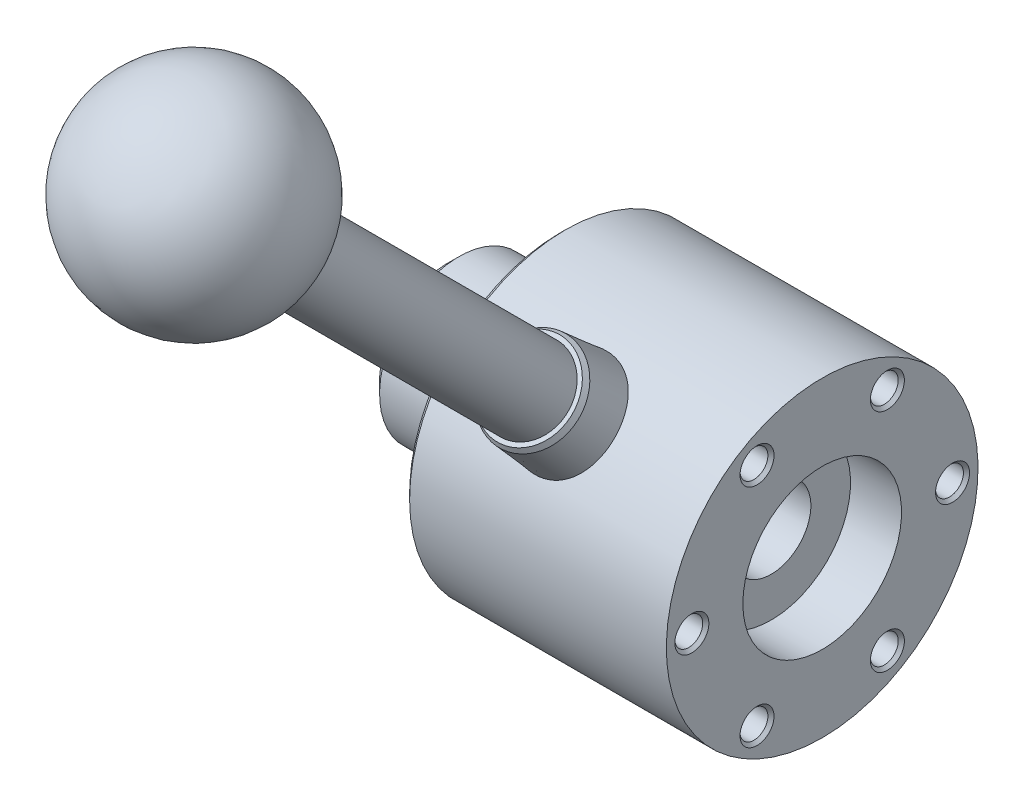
ISO-10303-21;
HEADER;
FILE_DESCRIPTION(('STEP AP214'),'2;1');
FILE_NAME('part.step','',(''),(''),'','','');
FILE_SCHEMA(('AUTOMOTIVE_DESIGN { 1 0 10303 214 1 1 1 1 }'));
ENDSEC;
DATA;
#1=APPLICATION_CONTEXT('core data for automotive mechanical design processes');
#2=APPLICATION_PROTOCOL_DEFINITION('international standard','automotive_design',2000,#1);
#3=PRODUCT_CONTEXT('',#1,'mechanical');
#4=PRODUCT('Part','Part','',(#3));
#5=PRODUCT_RELATED_PRODUCT_CATEGORY('part','',(#4));
#6=PRODUCT_DEFINITION_FORMATION('','',#4);
#7=PRODUCT_DEFINITION_CONTEXT('part definition',#1,'design');
#8=PRODUCT_DEFINITION('design','',#6,#7);
#9=PRODUCT_DEFINITION_SHAPE('','',#8);
#10=(LENGTH_UNIT() NAMED_UNIT(*) SI_UNIT(.MILLI.,.METRE.));
#11=(NAMED_UNIT(*) PLANE_ANGLE_UNIT() SI_UNIT($,.RADIAN.));
#12=(NAMED_UNIT(*) SI_UNIT($,.STERADIAN.) SOLID_ANGLE_UNIT());
#13=UNCERTAINTY_MEASURE_WITH_UNIT(LENGTH_MEASURE(1.E-05),#10,'distance_accuracy_value','');
#14=(GEOMETRIC_REPRESENTATION_CONTEXT(3) GLOBAL_UNCERTAINTY_ASSIGNED_CONTEXT((#13)) GLOBAL_UNIT_ASSIGNED_CONTEXT((#10,
#11,#12)) REPRESENTATION_CONTEXT('',''));
#15=CARTESIAN_POINT('',(0.,0.,0.));
#16=DIRECTION('',(0.,0.,1.));
#17=DIRECTION('',(1.,0.,0.));
#18=AXIS2_PLACEMENT_3D('',#15,#16,#17);
#19=CARTESIAN_POINT('',(0.,0.,0.));
#20=DIRECTION('',(-1.,0.,0.));
#21=DIRECTION('',(0.,-1.,0.));
#22=AXIS2_PLACEMENT_3D('',#19,#20,#21);
#23=CYLINDRICAL_SURFACE('',#22,14.);
#24=CARTESIAN_POINT('',(-64.1,0.,0.));
#25=DIRECTION('',(1.,0.,0.));
#26=DIRECTION('',(0.,0.,-1.));
#27=AXIS2_PLACEMENT_3D('',#24,#25,#26);
#28=CIRCLE('',#27,14.);
#29=CARTESIAN_POINT('',(-64.1,0.,-14.));
#30=VERTEX_POINT('',#29);
#31=EDGE_CURVE('E54',#30,#30,#28,.F.);
#32=ORIENTED_EDGE('',*,*,#31,.F.);
#33=EDGE_LOOP('',(#32));
#34=FACE_BOUND('',#33,.T.);
#35=CARTESIAN_POINT('',(-51.1,0.,0.));
#36=DIRECTION('',(-1.,0.,0.));
#37=DIRECTION('',(0.,-1.,0.));
#38=AXIS2_PLACEMENT_3D('',#35,#36,#37);
#39=CIRCLE('',#38,14.);
#40=CARTESIAN_POINT('',(-51.1,-14.,0.));
#41=VERTEX_POINT('',#40);
#42=EDGE_CURVE('E18',#41,#41,#39,.T.);
#43=ORIENTED_EDGE('',*,*,#42,.T.);
#44=EDGE_LOOP('',(#43));
#45=FACE_BOUND('',#44,.T.);
#46=ADVANCED_FACE('F14',(#34,#45),#23,.T.);
#47=CARTESIAN_POINT('',(-64.1,0.,0.));
#48=DIRECTION('',(1.,0.,0.));
#49=DIRECTION('',(0.,0.,-1.));
#50=AXIS2_PLACEMENT_3D('',#47,#48,#49);
#51=CONICAL_SURFACE('',#50,14.,0.785398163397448);
#52=ORIENTED_EDGE('',*,*,#31,.T.);
#53=EDGE_LOOP('',(#52));
#54=FACE_BOUND('',#53,.T.);
#55=CARTESIAN_POINT('',(-66.1,0.,0.));
#56=DIRECTION('',(1.,0.,0.));
#57=DIRECTION('',(0.,0.,-1.));
#58=AXIS2_PLACEMENT_3D('',#55,#56,#57);
#59=CIRCLE('',#58,12.);
#60=CARTESIAN_POINT('',(-66.1,0.,-12.));
#61=VERTEX_POINT('',#60);
#62=EDGE_CURVE('E147',#61,#61,#59,.T.);
#63=ORIENTED_EDGE('',*,*,#62,.T.);
#64=EDGE_LOOP('',(#63));
#65=FACE_BOUND('',#64,.T.);
#66=ADVANCED_FACE('F167',(#54,#65),#51,.T.);
#67=CARTESIAN_POINT('',(-26.,84.8528137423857,84.8528137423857));
#68=DIRECTION('',(-1.,0.,0.));
#69=DIRECTION('',(0.,0.707106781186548,-0.707106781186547));
#70=AXIS2_PLACEMENT_3D('',#67,#68,#69);
#71=SPHERICAL_SURFACE('',#70,18.5);
#72=CARTESIAN_POINT('',(-26.,84.8528137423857,84.8528137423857));
#73=DIRECTION('',(0.,0.707106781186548,0.707106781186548));
#74=DIRECTION('',(0.,-0.707106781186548,0.707106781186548));
#75=AXIS2_PLACEMENT_3D('',#72,#73,#74);
#76=SPHERICAL_SURFACE('',#75,18.5);
#77=CARTESIAN_POINT('',(-26.,72.7439327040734,72.7439327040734));
#78=DIRECTION('',(0.,0.707106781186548,0.707106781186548));
#79=DIRECTION('',(0.,-0.707106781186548,0.707106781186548));
#80=AXIS2_PLACEMENT_3D('',#77,#78,#79);
#81=CIRCLE('',#80,7.);
#82=CARTESIAN_POINT('',(-26.,67.7941852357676,77.6936801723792));
#83=VERTEX_POINT('',#82);
#84=EDGE_CURVE('E145',#83,#83,#81,.F.);
#85=ORIENTED_EDGE('',*,*,#84,.F.);
#86=EDGE_LOOP('',(#85));
#87=FACE_BOUND('',#86,.T.);
#88=ADVANCED_FACE('F16',(#87),#76,.T.);
#89=CARTESIAN_POINT('',(-51.1,14.,0.));
#90=DIRECTION('',(1.,0.,0.));
#91=DIRECTION('',(0.,1.,0.));
#92=AXIS2_PLACEMENT_3D('',#89,#90,#91);
#93=PLANE('',#92);
#94=CARTESIAN_POINT('',(-51.1,0.,0.));
#95=DIRECTION('',(-1.,0.,0.));
#96=DIRECTION('',(0.,-1.,0.));
#97=AXIS2_PLACEMENT_3D('',#94,#95,#96);
#98=CIRCLE('',#97,17.5);
#99=CARTESIAN_POINT('',(-51.1,-17.5,0.));
#100=VERTEX_POINT('',#99);
#101=EDGE_CURVE('E142',#100,#100,#98,.F.);
#102=ORIENTED_EDGE('',*,*,#101,.F.);
#103=EDGE_LOOP('',(#102));
#104=FACE_BOUND('',#103,.T.);
#105=ORIENTED_EDGE('',*,*,#42,.F.);
#106=EDGE_LOOP('',(#105));
#107=FACE_BOUND('',#106,.T.);
#108=ADVANCED_FACE('F155',(#104,#107),#93,.F.);
#109=CARTESIAN_POINT('',(-66.1,0.,0.));
#110=DIRECTION('',(1.,0.,0.));
#111=DIRECTION('',(0.,1.,0.));
#112=AXIS2_PLACEMENT_3D('',#109,#110,#111);
#113=PLANE('',#112);
#114=ORIENTED_EDGE('',*,*,#62,.F.);
#115=EDGE_LOOP('',(#114));
#116=FACE_BOUND('',#115,.T.);
#117=CARTESIAN_POINT('',(-66.1,0.,0.));
#118=DIRECTION('',(-1.,0.,0.));
#119=DIRECTION('',(0.,0.,1.));
#120=AXIS2_PLACEMENT_3D('',#117,#118,#119);
#121=CIRCLE('',#120,7.);
#122=CARTESIAN_POINT('',(-66.1,0.,7.));
#123=VERTEX_POINT('',#122);
#124=EDGE_CURVE('E139',#123,#123,#121,.F.);
#125=ORIENTED_EDGE('',*,*,#124,.T.);
#126=EDGE_LOOP('',(#125));
#127=FACE_BOUND('',#126,.T.);
#128=ADVANCED_FACE('F157',(#116,#127),#113,.F.);
#129=CARTESIAN_POINT('',(-26.,11.0293808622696,11.0293808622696));
#130=DIRECTION('',(0.,0.707106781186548,0.707106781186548));
#131=DIRECTION('',(0.,-0.707106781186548,0.707106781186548));
#132=AXIS2_PLACEMENT_3D('',#129,#130,#131);
#133=CYLINDRICAL_SURFACE('',#132,7.);
#134=ORIENTED_EDGE('',*,*,#84,.T.);
#135=EDGE_LOOP('',(#134));
#136=FACE_BOUND('',#135,.T.);
#137=CARTESIAN_POINT('',(-26.,25.809397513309,25.809397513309));
#138=DIRECTION('',(0.,0.707106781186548,0.707106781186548));
#139=DIRECTION('',(0.,-0.707106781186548,0.707106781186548));
#140=AXIS2_PLACEMENT_3D('',#137,#138,#139);
#141=CIRCLE('',#140,7.);
#142=CARTESIAN_POINT('',(-26.,20.8596500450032,30.7591449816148));
#143=VERTEX_POINT('',#142);
#144=EDGE_CURVE('E136',#143,#143,#141,.T.);
#145=ORIENTED_EDGE('',*,*,#144,.T.);
#146=EDGE_LOOP('',(#145));
#147=FACE_BOUND('',#146,.T.);
#148=ADVANCED_FACE('F164',(#136,#147),#133,.T.);
#149=CARTESIAN_POINT('',(0.,0.,0.));
#150=DIRECTION('',(-1.,0.,0.));
#151=DIRECTION('',(0.,-1.,0.));
#152=AXIS2_PLACEMENT_3D('',#149,#150,#151);
#153=CYLINDRICAL_SURFACE('',#152,17.5);
#154=ORIENTED_EDGE('',*,*,#101,.T.);
#155=EDGE_LOOP('',(#154));
#156=FACE_BOUND('',#155,.T.);
#157=CARTESIAN_POINT('',(-48.,0.,0.));
#158=DIRECTION('',(-1.,0.,0.));
#159=DIRECTION('',(0.,-1.,0.));
#160=AXIS2_PLACEMENT_3D('',#157,#158,#159);
#161=CIRCLE('',#160,17.5);
#162=CARTESIAN_POINT('',(-48.,-17.5,0.));
#163=VERTEX_POINT('',#162);
#164=EDGE_CURVE('E133',#163,#163,#161,.T.);
#165=ORIENTED_EDGE('',*,*,#164,.T.);
#166=EDGE_LOOP('',(#165));
#167=FACE_BOUND('',#166,.T.);
#168=ADVANCED_FACE('F212',(#156,#167),#153,.T.);
#169=CARTESIAN_POINT('',(-9.,0.,-23.));
#170=DIRECTION('',(1.,0.,0.));
#171=DIRECTION('',(0.,0.,-1.));
#172=AXIS2_PLACEMENT_3D('',#169,#170,#171);
#173=PLANE('',#172);
#174=CARTESIAN_POINT('',(-9.,0.,-23.));
#175=DIRECTION('',(-1.,0.,0.));
#176=DIRECTION('',(0.,0.,1.));
#177=AXIS2_PLACEMENT_3D('',#174,#175,#176);
#178=CIRCLE('',#177,2.4585);
#179=CARTESIAN_POINT('',(-9.,0.,-20.5415));
#180=VERTEX_POINT('',#179);
#181=EDGE_CURVE('E130',#180,#180,#178,.F.);
#182=ORIENTED_EDGE('',*,*,#181,.T.);
#183=EDGE_LOOP('',(#182));
#184=FACE_BOUND('',#183,.T.);
#185=ADVANCED_FACE('F221',(#184),#173,.T.);
#186=CARTESIAN_POINT('',(-9.,0.,25.4585));
#187=DIRECTION('',(1.,0.,0.));
#188=DIRECTION('',(0.,0.,-1.));
#189=AXIS2_PLACEMENT_3D('',#186,#187,#188);
#190=PLANE('',#189);
#191=CARTESIAN_POINT('',(-9.,0.,23.));
#192=DIRECTION('',(1.,0.,0.));
#193=DIRECTION('',(0.,0.,-1.));
#194=AXIS2_PLACEMENT_3D('',#191,#192,#193);
#195=CIRCLE('',#194,2.4585);
#196=CARTESIAN_POINT('',(-9.,0.,20.5415));
#197=VERTEX_POINT('',#196);
#198=EDGE_CURVE('E127',#197,#197,#195,.T.);
#199=ORIENTED_EDGE('',*,*,#198,.T.);
#200=EDGE_LOOP('',(#199));
#201=FACE_BOUND('',#200,.T.);
#202=ADVANCED_FACE('F231',(#201),#190,.T.);
#203=CARTESIAN_POINT('',(-9.,19.9185842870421,-11.5));
#204=DIRECTION('',(1.,0.,0.));
#205=DIRECTION('',(0.,0.,-1.));
#206=AXIS2_PLACEMENT_3D('',#203,#204,#205);
#207=PLANE('',#206);
#208=CARTESIAN_POINT('',(-9.,19.9185842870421,-11.5));
#209=DIRECTION('',(-1.,0.,0.));
#210=DIRECTION('',(0.,0.,1.));
#211=AXIS2_PLACEMENT_3D('',#208,#209,#210);
#212=CIRCLE('',#211,2.4585);
#213=CARTESIAN_POINT('',(-9.,19.9185842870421,-9.0415));
#214=VERTEX_POINT('',#213);
#215=EDGE_CURVE('E124',#214,#214,#212,.F.);
#216=ORIENTED_EDGE('',*,*,#215,.T.);
#217=EDGE_LOOP('',(#216));
#218=FACE_BOUND('',#217,.T.);
#219=ADVANCED_FACE('F241',(#218),#207,.T.);
#220=CARTESIAN_POINT('',(-9.,-22.0477077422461,12.72925));
#221=DIRECTION('',(1.,0.,0.));
#222=DIRECTION('',(0.,0.,-1.));
#223=AXIS2_PLACEMENT_3D('',#220,#221,#222);
#224=PLANE('',#223);
#225=CARTESIAN_POINT('',(-9.,-19.9185842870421,11.5));
#226=DIRECTION('',(1.,0.,0.));
#227=DIRECTION('',(0.,0.,-1.));
#228=AXIS2_PLACEMENT_3D('',#225,#226,#227);
#229=CIRCLE('',#228,2.4585);
#230=CARTESIAN_POINT('',(-9.,-19.9185842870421,9.0415));
#231=VERTEX_POINT('',#230);
#232=EDGE_CURVE('E121',#231,#231,#229,.T.);
#233=ORIENTED_EDGE('',*,*,#232,.T.);
#234=EDGE_LOOP('',(#233));
#235=FACE_BOUND('',#234,.T.);
#236=ADVANCED_FACE('F251',(#235),#224,.T.);
#237=CARTESIAN_POINT('',(-9.,-22.0477077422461,-12.72925));
#238=DIRECTION('',(1.,0.,0.));
#239=DIRECTION('',(0.,0.,-1.));
#240=AXIS2_PLACEMENT_3D('',#237,#238,#239);
#241=PLANE('',#240);
#242=CARTESIAN_POINT('',(-9.,-19.9185842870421,-11.5));
#243=DIRECTION('',(1.,0.,0.));
#244=DIRECTION('',(0.,0.,-1.));
#245=AXIS2_PLACEMENT_3D('',#242,#243,#244);
#246=CIRCLE('',#245,2.4585);
#247=CARTESIAN_POINT('',(-9.,-19.9185842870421,-13.9585));
#248=VERTEX_POINT('',#247);
#249=EDGE_CURVE('E118',#248,#248,#246,.T.);
#250=ORIENTED_EDGE('',*,*,#249,.T.);
#251=EDGE_LOOP('',(#250));
#252=FACE_BOUND('',#251,.T.);
#253=ADVANCED_FACE('F261',(#252),#241,.T.);
#254=CARTESIAN_POINT('',(-9.,19.9185842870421,11.5));
#255=DIRECTION('',(1.,0.,0.));
#256=DIRECTION('',(0.,0.,-1.));
#257=AXIS2_PLACEMENT_3D('',#254,#255,#256);
#258=PLANE('',#257);
#259=CARTESIAN_POINT('',(-9.,19.9185842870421,11.5));
#260=DIRECTION('',(-1.,0.,0.));
#261=DIRECTION('',(0.,0.,1.));
#262=AXIS2_PLACEMENT_3D('',#259,#260,#261);
#263=CIRCLE('',#262,2.4585);
#264=CARTESIAN_POINT('',(-9.,19.9185842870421,13.9585));
#265=VERTEX_POINT('',#264);
#266=EDGE_CURVE('E115',#265,#265,#263,.F.);
#267=ORIENTED_EDGE('',*,*,#266,.T.);
#268=EDGE_LOOP('',(#267));
#269=FACE_BOUND('',#268,.T.);
#270=ADVANCED_FACE('F271',(#269),#258,.T.);
#271=CARTESIAN_POINT('',(0.,0.,0.));
#272=DIRECTION('',(-1.,0.,0.));
#273=DIRECTION('',(0.,0.,1.));
#274=AXIS2_PLACEMENT_3D('',#271,#272,#273);
#275=CYLINDRICAL_SURFACE('',#274,7.);
#276=ORIENTED_EDGE('',*,*,#124,.F.);
#277=EDGE_LOOP('',(#276));
#278=FACE_BOUND('',#277,.T.);
#279=CARTESIAN_POINT('',(-9.,0.,0.));
#280=DIRECTION('',(-1.,0.,0.));
#281=DIRECTION('',(0.,0.,1.));
#282=AXIS2_PLACEMENT_3D('',#279,#280,#281);
#283=CIRCLE('',#282,7.);
#284=CARTESIAN_POINT('',(-9.,0.,7.));
#285=VERTEX_POINT('',#284);
#286=EDGE_CURVE('E112',#285,#285,#283,.T.);
#287=ORIENTED_EDGE('',*,*,#286,.F.);
#288=EDGE_LOOP('',(#287));
#289=FACE_BOUND('',#288,.T.);
#290=ADVANCED_FACE('F281',(#278,#289),#275,.F.);
#291=CARTESIAN_POINT('',(-33.,25.809397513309,25.809397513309));
#292=DIRECTION('',(0.,-0.707106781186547,-0.707106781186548));
#293=DIRECTION('',(0.,0.707106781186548,-0.707106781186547));
#294=AXIS2_PLACEMENT_3D('',#291,#292,#293);
#295=PLANE('',#294);
#296=CARTESIAN_POINT('',(-26.,25.809397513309,25.809397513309));
#297=DIRECTION('',(0.,-0.707106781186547,-0.707106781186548));
#298=DIRECTION('',(0.,0.707106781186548,-0.707106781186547));
#299=AXIS2_PLACEMENT_3D('',#296,#297,#298);
#300=CIRCLE('',#299,7.75000000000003);
#301=CARTESIAN_POINT('',(-26.,31.2894750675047,20.3293199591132));
#302=VERTEX_POINT('',#301);
#303=EDGE_CURVE('E109',#302,#302,#300,.T.);
#304=ORIENTED_EDGE('',*,*,#303,.F.);
#305=EDGE_LOOP('',(#304));
#306=FACE_BOUND('',#305,.T.);
#307=ORIENTED_EDGE('',*,*,#144,.F.);
#308=EDGE_LOOP('',(#307));
#309=FACE_BOUND('',#308,.T.);
#310=ADVANCED_FACE('F291',(#306,#309),#295,.F.);
#311=CARTESIAN_POINT('',(-48.,17.5,0.));
#312=DIRECTION('',(1.,0.,0.));
#313=DIRECTION('',(0.,1.,0.));
#314=AXIS2_PLACEMENT_3D('',#311,#312,#313);
#315=PLANE('',#314);
#316=CARTESIAN_POINT('',(-48.,0.,0.));
#317=DIRECTION('',(-1.,0.,0.));
#318=DIRECTION('',(0.,-1.,0.));
#319=AXIS2_PLACEMENT_3D('',#316,#317,#318);
#320=CIRCLE('',#319,21.25);
#321=CARTESIAN_POINT('',(-48.,-21.25,0.));
#322=VERTEX_POINT('',#321);
#323=EDGE_CURVE('E53',#322,#322,#320,.F.);
#324=ORIENTED_EDGE('',*,*,#323,.F.);
#325=EDGE_LOOP('',(#324));
#326=FACE_BOUND('',#325,.T.);
#327=ORIENTED_EDGE('',*,*,#164,.F.);
#328=EDGE_LOOP('',(#327));
#329=FACE_BOUND('',#328,.T.);
#330=ADVANCED_FACE('F301',(#326,#329),#315,.F.);
#331=CARTESIAN_POINT('',(0.,0.,-23.));
#332=DIRECTION('',(-1.,0.,0.));
#333=DIRECTION('',(0.,0.,1.));
#334=AXIS2_PLACEMENT_3D('',#331,#332,#333);
#335=CYLINDRICAL_SURFACE('',#334,2.4585);
#336=CARTESIAN_POINT('',(-0.541499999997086,0.,-23.));
#337=DIRECTION('',(1.,0.,0.));
#338=DIRECTION('',(0.,0.,-1.));
#339=AXIS2_PLACEMENT_3D('',#336,#337,#338);
#340=CIRCLE('',#339,2.45850000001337);
#341=CARTESIAN_POINT('',(-0.541499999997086,0.,-25.4585000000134));
#342=VERTEX_POINT('',#341);
#343=EDGE_CURVE('E50',#342,#342,#340,.T.);
#344=ORIENTED_EDGE('',*,*,#343,.T.);
#345=EDGE_LOOP('',(#344));
#346=FACE_BOUND('',#345,.T.);
#347=ORIENTED_EDGE('',*,*,#181,.F.);
#348=EDGE_LOOP('',(#347));
#349=FACE_BOUND('',#348,.T.);
#350=ADVANCED_FACE('F311',(#346,#349),#335,.F.);
#351=CARTESIAN_POINT('',(-9.,0.,23.));
#352=DIRECTION('',(1.,0.,0.));
#353=DIRECTION('',(0.,0.,-1.));
#354=AXIS2_PLACEMENT_3D('',#351,#352,#353);
#355=CYLINDRICAL_SURFACE('',#354,2.4585);
#356=ORIENTED_EDGE('',*,*,#198,.F.);
#357=EDGE_LOOP('',(#356));
#358=FACE_BOUND('',#357,.T.);
#359=CARTESIAN_POINT('',(-0.541500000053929,0.,23.));
#360=DIRECTION('',(1.,0.,0.));
#361=DIRECTION('',(0.,0.,-1.));
#362=AXIS2_PLACEMENT_3D('',#359,#360,#361);
#363=CIRCLE('',#362,2.45849999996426);
#364=CARTESIAN_POINT('',(-0.541500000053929,0.,20.5415000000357));
#365=VERTEX_POINT('',#364);
#366=EDGE_CURVE('E47',#365,#365,#363,.T.);
#367=ORIENTED_EDGE('',*,*,#366,.T.);
#368=EDGE_LOOP('',(#367));
#369=FACE_BOUND('',#368,.T.);
#370=ADVANCED_FACE('F321',(#358,#369),#355,.F.);
#371=CARTESIAN_POINT('',(0.,19.9185842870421,-11.5));
#372=DIRECTION('',(-1.,0.,0.));
#373=DIRECTION('',(0.,0.,1.));
#374=AXIS2_PLACEMENT_3D('',#371,#372,#373);
#375=CYLINDRICAL_SURFACE('',#374,2.4585);
#376=CARTESIAN_POINT('',(-0.541499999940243,19.9185842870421,-11.5));
#377=DIRECTION('',(1.,0.,0.));
#378=DIRECTION('',(0.,0.,-1.));
#379=AXIS2_PLACEMENT_3D('',#376,#377,#378);
#380=CIRCLE('',#379,2.4585000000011);
#381=CARTESIAN_POINT('',(-0.541499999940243,19.9185842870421,-13.9585000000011));
#382=VERTEX_POINT('',#381);
#383=EDGE_CURVE('E44',#382,#382,#380,.T.);
#384=ORIENTED_EDGE('',*,*,#383,.T.);
#385=EDGE_LOOP('',(#384));
#386=FACE_BOUND('',#385,.T.);
#387=ORIENTED_EDGE('',*,*,#215,.F.);
#388=EDGE_LOOP('',(#387));
#389=FACE_BOUND('',#388,.T.);
#390=ADVANCED_FACE('F331',(#386,#389),#375,.F.);
#391=CARTESIAN_POINT('',(-9.,-19.9185842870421,11.5));
#392=DIRECTION('',(1.,0.,0.));
#393=DIRECTION('',(0.,0.,-1.));
#394=AXIS2_PLACEMENT_3D('',#391,#392,#393);
#395=CYLINDRICAL_SURFACE('',#394,2.4585);
#396=ORIENTED_EDGE('',*,*,#232,.F.);
#397=EDGE_LOOP('',(#396));
#398=FACE_BOUND('',#397,.T.);
#399=CARTESIAN_POINT('',(-0.541500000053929,-19.9185842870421,11.5));
#400=DIRECTION('',(1.,0.,0.));
#401=DIRECTION('',(0.,0.,-1.));
#402=AXIS2_PLACEMENT_3D('',#399,#400,#401);
#403=CIRCLE('',#402,2.45849999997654);
#404=CARTESIAN_POINT('',(-0.541500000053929,-19.9185842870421,9.04150000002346));
#405=VERTEX_POINT('',#404);
#406=EDGE_CURVE('E41',#405,#405,#403,.T.);
#407=ORIENTED_EDGE('',*,*,#406,.T.);
#408=EDGE_LOOP('',(#407));
#409=FACE_BOUND('',#408,.T.);
#410=ADVANCED_FACE('F341',(#398,#409),#395,.F.);
#411=CARTESIAN_POINT('',(-9.,-19.9185842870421,-11.5));
#412=DIRECTION('',(1.,0.,0.));
#413=DIRECTION('',(0.,0.,-1.));
#414=AXIS2_PLACEMENT_3D('',#411,#412,#413);
#415=CYLINDRICAL_SURFACE('',#414,2.4585);
#416=ORIENTED_EDGE('',*,*,#249,.F.);
#417=EDGE_LOOP('',(#416));
#418=FACE_BOUND('',#417,.T.);
#419=CARTESIAN_POINT('',(-0.541499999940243,-19.9185842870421,-11.5));
#420=DIRECTION('',(1.,0.,0.));
#421=DIRECTION('',(0.,0.,-1.));
#422=AXIS2_PLACEMENT_3D('',#419,#420,#421);
#423=CIRCLE('',#422,2.4585000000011);
#424=CARTESIAN_POINT('',(-0.541499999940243,-19.9185842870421,-13.9585000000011));
#425=VERTEX_POINT('',#424);
#426=EDGE_CURVE('E38',#425,#425,#423,.T.);
#427=ORIENTED_EDGE('',*,*,#426,.T.);
#428=EDGE_LOOP('',(#427));
#429=FACE_BOUND('',#428,.T.);
#430=ADVANCED_FACE('F351',(#418,#429),#415,.F.);
#431=CARTESIAN_POINT('',(0.,19.9185842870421,11.5));
#432=DIRECTION('',(-1.,0.,0.));
#433=DIRECTION('',(0.,0.,1.));
#434=AXIS2_PLACEMENT_3D('',#431,#432,#433);
#435=CYLINDRICAL_SURFACE('',#434,2.4585);
#436=CARTESIAN_POINT('',(-0.541500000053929,19.9185842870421,11.5));
#437=DIRECTION('',(1.,0.,0.));
#438=DIRECTION('',(0.,0.,-1.));
#439=AXIS2_PLACEMENT_3D('',#436,#437,#438);
#440=CIRCLE('',#439,2.45849999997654);
#441=CARTESIAN_POINT('',(-0.541500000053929,19.9185842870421,9.04150000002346));
#442=VERTEX_POINT('',#441);
#443=EDGE_CURVE('E35',#442,#442,#440,.T.);
#444=ORIENTED_EDGE('',*,*,#443,.T.);
#445=EDGE_LOOP('',(#444));
#446=FACE_BOUND('',#445,.T.);
#447=ORIENTED_EDGE('',*,*,#266,.F.);
#448=EDGE_LOOP('',(#447));
#449=FACE_BOUND('',#448,.T.);
#450=ADVANCED_FACE('F361',(#446,#449),#435,.F.);
#451=CARTESIAN_POINT('',(-9.,7.,0.));
#452=DIRECTION('',(1.,0.,0.));
#453=DIRECTION('',(0.,0.,-1.));
#454=AXIS2_PLACEMENT_3D('',#451,#452,#453);
#455=PLANE('',#454);
#456=CARTESIAN_POINT('',(-9.,0.,0.));
#457=DIRECTION('',(-1.,0.,0.));
#458=DIRECTION('',(0.,0.,1.));
#459=AXIS2_PLACEMENT_3D('',#456,#457,#458);
#460=CIRCLE('',#459,14.);
#461=CARTESIAN_POINT('',(-9.,0.,14.));
#462=VERTEX_POINT('',#461);
#463=EDGE_CURVE('E34',#462,#462,#460,.F.);
#464=ORIENTED_EDGE('',*,*,#463,.T.);
#465=EDGE_LOOP('',(#464));
#466=FACE_BOUND('',#465,.T.);
#467=ORIENTED_EDGE('',*,*,#286,.T.);
#468=EDGE_LOOP('',(#467));
#469=FACE_BOUND('',#468,.T.);
#470=ADVANCED_FACE('F371',(#466,#469),#455,.T.);
#471=CARTESIAN_POINT('',(-26.,25.1022907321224,25.1022907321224));
#472=DIRECTION('',(0.,-0.707106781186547,-0.707106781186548));
#473=DIRECTION('',(0.,0.707106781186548,-0.707106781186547));
#474=AXIS2_PLACEMENT_3D('',#471,#472,#473);
#475=CONICAL_SURFACE('',#474,8.25000000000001,0.463647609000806);
#476=ORIENTED_EDGE('',*,*,#303,.T.);
#477=EDGE_LOOP('',(#476));
#478=FACE_BOUND('',#477,.T.);
#479=CARTESIAN_POINT('',(-26.,25.1022907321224,25.1022907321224));
#480=DIRECTION('',(0.,-0.707106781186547,-0.707106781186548));
#481=DIRECTION('',(0.,0.707106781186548,-0.707106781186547));
#482=AXIS2_PLACEMENT_3D('',#479,#480,#481);
#483=CIRCLE('',#482,8.24999999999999);
#484=CARTESIAN_POINT('',(-26.,30.9359216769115,19.2686597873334));
#485=VERTEX_POINT('',#484);
#486=EDGE_CURVE('E30',#485,#485,#483,.T.);
#487=ORIENTED_EDGE('',*,*,#486,.F.);
#488=EDGE_LOOP('',(#487));
#489=FACE_BOUND('',#488,.T.);
#490=ADVANCED_FACE('F381',(#478,#489),#475,.T.);
#491=CARTESIAN_POINT('',(0.,0.,0.));
#492=DIRECTION('',(-1.,0.,0.));
#493=DIRECTION('',(0.,-1.,0.));
#494=AXIS2_PLACEMENT_3D('',#491,#492,#493);
#495=CYLINDRICAL_SURFACE('',#494,21.25);
#496=ORIENTED_EDGE('',*,*,#323,.T.);
#497=EDGE_LOOP('',(#496));
#498=FACE_BOUND('',#497,.T.);
#499=CARTESIAN_POINT('',(-46.3,0.,0.));
#500=DIRECTION('',(-1.,0.,0.));
#501=DIRECTION('',(0.,-1.,0.));
#502=AXIS2_PLACEMENT_3D('',#499,#500,#501);
#503=CIRCLE('',#502,21.25);
#504=CARTESIAN_POINT('',(-46.3,-21.25,0.));
#505=VERTEX_POINT('',#504);
#506=EDGE_CURVE('E33',#505,#505,#503,.T.);
#507=ORIENTED_EDGE('',*,*,#506,.T.);
#508=EDGE_LOOP('',(#507));
#509=FACE_BOUND('',#508,.T.);
#510=ADVANCED_FACE('F391',(#498,#509),#495,.T.);
#511=CARTESIAN_POINT('',(0.,0.,-23.));
#512=DIRECTION('',(1.,0.,0.));
#513=DIRECTION('',(0.,0.,-1.));
#514=AXIS2_PLACEMENT_3D('',#511,#512,#513);
#515=CONICAL_SURFACE('',#514,3.00000000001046,0.785398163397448);
#516=ORIENTED_EDGE('',*,*,#343,.F.);
#517=EDGE_LOOP('',(#516));
#518=FACE_BOUND('',#517,.T.);
#519=CARTESIAN_POINT('',(0.,0.,-23.));
#520=DIRECTION('',(1.,0.,0.));
#521=DIRECTION('',(0.,0.,-1.));
#522=AXIS2_PLACEMENT_3D('',#519,#520,#521);
#523=CIRCLE('',#522,3.00000000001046);
#524=CARTESIAN_POINT('',(0.,0.,-26.0000000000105));
#525=VERTEX_POINT('',#524);
#526=EDGE_CURVE('E98',#525,#525,#523,.T.);
#527=ORIENTED_EDGE('',*,*,#526,.T.);
#528=EDGE_LOOP('',(#527));
#529=FACE_BOUND('',#528,.T.);
#530=ADVANCED_FACE('F401',(#518,#529),#515,.F.);
#531=CARTESIAN_POINT('',(-5.6843418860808E-11,0.,23.));
#532=DIRECTION('',(1.,0.,0.));
#533=DIRECTION('',(0.,0.,-1.));
#534=AXIS2_PLACEMENT_3D('',#531,#532,#533);
#535=CONICAL_SURFACE('',#534,3.00000000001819,0.785398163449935);
#536=ORIENTED_EDGE('',*,*,#366,.F.);
#537=EDGE_LOOP('',(#536));
#538=FACE_BOUND('',#537,.T.);
#539=CARTESIAN_POINT('',(-8.91300921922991E-11,0.,23.));
#540=DIRECTION('',(1.,0.,0.));
#541=DIRECTION('',(0.,0.,-1.));
#542=AXIS2_PLACEMENT_3D('',#539,#540,#541);
#543=CIRCLE('',#542,2.9999999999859);
#544=CARTESIAN_POINT('',(-8.91300921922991E-11,0.,20.0000000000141));
#545=VERTEX_POINT('',#544);
#546=EDGE_CURVE('E101',#545,#545,#543,.T.);
#547=ORIENTED_EDGE('',*,*,#546,.T.);
#548=EDGE_LOOP('',(#547));
#549=FACE_BOUND('',#548,.T.);
#550=ADVANCED_FACE('F411',(#538,#549),#535,.F.);
#551=CARTESIAN_POINT('',(5.6843418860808E-11,19.9185842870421,-11.5));
#552=DIRECTION('',(1.,0.,0.));
#553=DIRECTION('',(0.,0.,-1.));
#554=AXIS2_PLACEMENT_3D('',#551,#552,#553);
#555=CONICAL_SURFACE('',#554,2.99999999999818,0.785398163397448);
#556=ORIENTED_EDGE('',*,*,#383,.F.);
#557=EDGE_LOOP('',(#556));
#558=FACE_BOUND('',#557,.T.);
#559=CARTESIAN_POINT('',(5.6843418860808E-11,19.9185842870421,-11.5));
#560=DIRECTION('',(1.,0.,0.));
#561=DIRECTION('',(0.,0.,-1.));
#562=AXIS2_PLACEMENT_3D('',#559,#560,#561);
#563=CIRCLE('',#562,2.99999999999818);
#564=CARTESIAN_POINT('',(5.6843418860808E-11,19.9185842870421,-14.4999999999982));
#565=VERTEX_POINT('',#564);
#566=EDGE_CURVE('E631',#565,#565,#563,.T.);
#567=ORIENTED_EDGE('',*,*,#566,.T.);
#568=EDGE_LOOP('',(#567));
#569=FACE_BOUND('',#568,.T.);
#570=ADVANCED_FACE('F421',(#558,#569),#555,.F.);
#571=CARTESIAN_POINT('',(-1.13686837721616E-10,-19.9185842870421,11.5));
#572=DIRECTION('',(1.,0.,0.));
#573=DIRECTION('',(0.,0.,-1.));
#574=AXIS2_PLACEMENT_3D('',#571,#572,#573);
#575=CONICAL_SURFACE('',#574,2.99999999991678,0.785398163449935);
#576=ORIENTED_EDGE('',*,*,#406,.F.);
#577=EDGE_LOOP('',(#576));
#578=FACE_BOUND('',#577,.T.);
#579=CARTESIAN_POINT('',(-4.45650461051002E-11,-19.9185842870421,11.5));
#580=DIRECTION('',(1.,0.,0.));
#581=DIRECTION('',(0.,0.,-1.));
#582=AXIS2_PLACEMENT_3D('',#579,#580,#581);
#583=CIRCLE('',#582,2.9999999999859);
#584=CARTESIAN_POINT('',(-4.45650461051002E-11,-19.9185842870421,8.5000000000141));
#585=VERTEX_POINT('',#584);
#586=EDGE_CURVE('E626',#585,#585,#583,.T.);
#587=ORIENTED_EDGE('',*,*,#586,.T.);
#588=EDGE_LOOP('',(#587));
#589=FACE_BOUND('',#588,.T.);
#590=ADVANCED_FACE('F431',(#578,#589),#575,.F.);
#591=CARTESIAN_POINT('',(1.70530256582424E-10,-19.9185842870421,-11.5));
#592=DIRECTION('',(1.,0.,0.));
#593=DIRECTION('',(0.,0.,-1.));
#594=AXIS2_PLACEMENT_3D('',#591,#592,#593);
#595=CONICAL_SURFACE('',#594,3.00000000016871,0.785398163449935);
#596=ORIENTED_EDGE('',*,*,#426,.F.);
#597=EDGE_LOOP('',(#596));
#598=FACE_BOUND('',#597,.T.);
#599=CARTESIAN_POINT('',(1.01408464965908E-10,-19.9185842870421,-11.5));
#600=DIRECTION('',(1.,0.,0.));
#601=DIRECTION('',(0.,0.,-1.));
#602=AXIS2_PLACEMENT_3D('',#599,#600,#601);
#603=CIRCLE('',#602,3.00000000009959);
#604=CARTESIAN_POINT('',(1.01408464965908E-10,-19.9185842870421,-14.5000000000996));
#605=VERTEX_POINT('',#604);
#606=EDGE_CURVE('E622',#605,#605,#603,.T.);
#607=ORIENTED_EDGE('',*,*,#606,.T.);
#608=EDGE_LOOP('',(#607));
#609=FACE_BOUND('',#608,.T.);
#610=ADVANCED_FACE('F441',(#598,#609),#595,.F.);
#611=CARTESIAN_POINT('',(-1.13686837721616E-10,19.9185842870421,11.5));
#612=DIRECTION('',(1.,0.,0.));
#613=DIRECTION('',(0.,0.,-1.));
#614=AXIS2_PLACEMENT_3D('',#611,#612,#613);
#615=CONICAL_SURFACE('',#614,2.99999999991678,0.785398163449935);
#616=ORIENTED_EDGE('',*,*,#443,.F.);
#617=EDGE_LOOP('',(#616));
#618=FACE_BOUND('',#617,.T.);
#619=CARTESIAN_POINT('',(-4.45650461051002E-11,19.9185842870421,11.5));
#620=DIRECTION('',(1.,0.,0.));
#621=DIRECTION('',(0.,0.,-1.));
#622=AXIS2_PLACEMENT_3D('',#619,#620,#621);
#623=CIRCLE('',#622,2.9999999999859);
#624=CARTESIAN_POINT('',(-4.45650461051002E-11,19.9185842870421,8.5000000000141));
#625=VERTEX_POINT('',#624);
#626=EDGE_CURVE('E620',#625,#625,#623,.T.);
#627=ORIENTED_EDGE('',*,*,#626,.T.);
#628=EDGE_LOOP('',(#627));
#629=FACE_BOUND('',#628,.T.);
#630=ADVANCED_FACE('F451',(#618,#629),#615,.F.);
#631=CARTESIAN_POINT('',(0.,0.,0.));
#632=DIRECTION('',(-1.,0.,0.));
#633=DIRECTION('',(0.,0.,1.));
#634=AXIS2_PLACEMENT_3D('',#631,#632,#633);
#635=CYLINDRICAL_SURFACE('',#634,14.);
#636=ORIENTED_EDGE('',*,*,#463,.F.);
#637=EDGE_LOOP('',(#636));
#638=FACE_BOUND('',#637,.T.);
#639=CARTESIAN_POINT('',(0.,0.,0.));
#640=DIRECTION('',(-1.,0.,0.));
#641=DIRECTION('',(0.,0.,1.));
#642=AXIS2_PLACEMENT_3D('',#639,#640,#641);
#643=CIRCLE('',#642,14.);
#644=CARTESIAN_POINT('',(0.,0.,14.));
#645=VERTEX_POINT('',#644);
#646=EDGE_CURVE('E66',#645,#645,#643,.F.);
#647=ORIENTED_EDGE('',*,*,#646,.T.);
#648=EDGE_LOOP('',(#647));
#649=FACE_BOUND('',#648,.T.);
#650=ADVANCED_FACE('F91',(#638,#649),#635,.F.);
#651=CARTESIAN_POINT('',(-26.,18.3554726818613,18.3554726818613));
#652=DIRECTION('',(0.,-0.707106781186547,-0.707106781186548));
#653=DIRECTION('',(0.,0.707106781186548,-0.707106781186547));
#654=AXIS2_PLACEMENT_3D('',#651,#652,#653);
#655=CONICAL_SURFACE('',#654,8.91720259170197,0.0698131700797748);
#656=ORIENTED_EDGE('',*,*,#486,.T.);
#657=EDGE_LOOP('',(#656));
#658=FACE_BOUND('',#657,.T.);
#659=CARTESIAN_POINT('',(-26.,12.0931115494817,24.6983127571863));
#660=CARTESIAN_POINT('',(-26.2373684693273,12.0931117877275,24.6983127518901));
#661=CARTESIAN_POINT('',(-26.4747409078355,12.1023471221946,24.6937971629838));
#662=CARTESIAN_POINT('',(-26.9478000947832,12.1391482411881,24.6757268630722));
#663=CARTESIAN_POINT('',(-27.1834861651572,12.1667210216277,24.6621687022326));
#664=CARTESIAN_POINT('',(-27.651659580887,12.2398188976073,24.6259719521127));
#665=CARTESIAN_POINT('',(-27.8841424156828,12.2853670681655,24.6033216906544));
#666=CARTESIAN_POINT('',(-28.3440428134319,12.3937434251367,24.548906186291));
#667=CARTESIAN_POINT('',(-28.5714583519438,12.4565783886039,24.5171373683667));
#668=CARTESIAN_POINT('',(-29.0189164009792,12.5984026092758,24.4445612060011));
#669=CARTESIAN_POINT('',(-29.2389797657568,12.6773406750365,24.4037824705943));
#670=CARTESIAN_POINT('',(-29.6711292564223,12.8504311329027,24.3130818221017));
#671=CARTESIAN_POINT('',(-29.8832123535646,12.9445892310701,24.2631564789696));
#672=CARTESIAN_POINT('',(-30.5053003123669,13.2480542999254,24.0996260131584));
#673=CARTESIAN_POINT('',(-30.9016487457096,13.4785152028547,23.9721858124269));
#674=CARTESIAN_POINT('',(-31.6638137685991,13.9959366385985,23.6739536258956));
#675=CARTESIAN_POINT('',(-32.0277029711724,14.2848318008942,23.5015935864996));
#676=CARTESIAN_POINT('',(-32.5297951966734,14.7462269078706,23.2127530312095));
#677=CARTESIAN_POINT('',(-32.6899561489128,14.9048095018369,23.1113492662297));
#678=CARTESIAN_POINT('',(-32.9947898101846,15.2298504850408,22.8984569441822));
#679=CARTESIAN_POINT('',(-33.1394680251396,15.3963060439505,22.7869719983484));
#680=CARTESIAN_POINT('',(-33.4175061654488,15.7418576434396,22.5497109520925));
#681=CARTESIAN_POINT('',(-33.5502460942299,15.9211935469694,22.4235578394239));
#682=CARTESIAN_POINT('',(-33.7970986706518,16.2848707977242,22.1608499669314));
#683=CARTESIAN_POINT('',(-33.9112183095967,16.469210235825,22.0242991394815));
#684=CARTESIAN_POINT('',(-34.1200059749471,16.8412054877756,21.7411690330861));
#685=CARTESIAN_POINT('',(-34.2146727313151,17.0288615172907,21.5945891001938));
#686=CARTESIAN_POINT('',(-34.3837508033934,17.4057032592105,21.2920142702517));
#687=CARTESIAN_POINT('',(-34.4581627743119,17.5948889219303,21.1360196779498));
#688=CARTESIAN_POINT('',(-34.5846290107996,17.9687742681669,20.8190264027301));
#689=CARTESIAN_POINT('',(-34.6371490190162,18.1534790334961,20.6582195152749));
#690=CARTESIAN_POINT('',(-34.7217329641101,18.5210702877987,20.3293082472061));
#691=CARTESIAN_POINT('',(-34.7537971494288,18.7039567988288,20.1612039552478));
#692=CARTESIAN_POINT('',(-34.7971667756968,19.0663417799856,19.81884788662));
#693=CARTESIAN_POINT('',(-34.8084762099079,19.2458408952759,19.6445972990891));
#694=CARTESIAN_POINT('',(-34.8102406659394,19.6000550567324,19.2912007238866));
#695=CARTESIAN_POINT('',(-34.8006961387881,19.7747702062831,19.1120548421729));
#696=CARTESIAN_POINT('',(-34.7615232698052,20.1122868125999,18.7564380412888));
#697=CARTESIAN_POINT('',(-34.7325881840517,20.275291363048,18.5800829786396));
#698=CARTESIAN_POINT('',(-34.6555827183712,20.59466789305,18.2254387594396));
#699=CARTESIAN_POINT('',(-34.6075055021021,20.7510374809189,18.0471489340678));
#700=CARTESIAN_POINT('',(-34.4926310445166,21.0561883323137,17.6901686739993));
#701=CARTESIAN_POINT('',(-34.4258369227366,21.2049708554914,17.5114783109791));
#702=CARTESIAN_POINT('',(-34.2740595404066,21.4942792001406,17.1551345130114));
#703=CARTESIAN_POINT('',(-34.1890754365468,21.6348046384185,16.9774811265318));
#704=CARTESIAN_POINT('',(-34.0006290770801,21.9084039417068,16.6229502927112));
#705=CARTESIAN_POINT('',(-33.8969911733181,22.0413896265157,16.4460982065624));
#706=CARTESIAN_POINT('',(-33.6725679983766,22.2979690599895,16.0965088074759));
#707=CARTESIAN_POINT('',(-33.5517822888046,22.4215625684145,15.9237715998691));
#708=CARTESIAN_POINT('',(-33.2938794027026,22.659079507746,15.5839371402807));
#709=CARTESIAN_POINT('',(-33.1567622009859,22.7730029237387,15.4168398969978));
#710=CARTESIAN_POINT('',(-32.8670159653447,22.991050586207,15.0897398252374));
#711=CARTESIAN_POINT('',(-32.7143817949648,23.0951715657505,14.9297393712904));
#712=CARTESIAN_POINT('',(-32.3884384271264,23.2972843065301,14.6124353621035));
#713=CARTESIAN_POINT('',(-32.2145624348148,23.3948904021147,14.4554678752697));
#714=CARTESIAN_POINT('',(-31.8521868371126,23.5793992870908,14.1525049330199));
#715=CARTESIAN_POINT('',(-31.6636871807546,23.6663020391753,14.006509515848));
#716=CARTESIAN_POINT('',(-31.2730776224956,23.8294957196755,13.7270296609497));
#717=CARTESIAN_POINT('',(-31.0709588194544,23.9057796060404,13.5935535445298));
#718=CARTESIAN_POINT('',(-30.654543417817,24.0477029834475,13.3408762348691));
#719=CARTESIAN_POINT('',(-30.4402516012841,24.1133466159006,13.2216694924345));
#720=CARTESIAN_POINT('',(-29.9997779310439,24.234373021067,12.9985136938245));
#721=CARTESIAN_POINT('',(-29.7735465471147,24.2897078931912,12.8946363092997));
#722=CARTESIAN_POINT('',(-29.3117185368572,24.3897960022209,12.7043070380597));
#723=CARTESIAN_POINT('',(-29.0761260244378,24.4345538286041,12.6178475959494));
#724=CARTESIAN_POINT('',(-28.5975907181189,24.5135109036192,12.4637583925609));
#725=CARTESIAN_POINT('',(-28.3546612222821,24.5477281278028,12.3960965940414));
#726=CARTESIAN_POINT('',(-27.8630317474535,24.6057395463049,12.2805444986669));
#727=CARTESIAN_POINT('',(-27.614334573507,24.6295386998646,12.2326447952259));
#728=CARTESIAN_POINT('',(-27.1385162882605,24.6648782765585,12.1612166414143));
#729=CARTESIAN_POINT('',(-26.911763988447,24.6774169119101,12.1357096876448));
#730=CARTESIAN_POINT('',(-26.4566756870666,24.6941341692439,12.1016569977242));
#731=CARTESIAN_POINT('',(-26.2283396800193,24.6983127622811,12.093111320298));
#732=CARTESIAN_POINT('',(-25.7626315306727,24.6983127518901,12.0931117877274));
#733=CARTESIAN_POINT('',(-25.5252590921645,24.6937971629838,12.1023471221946));
#734=CARTESIAN_POINT('',(-25.0521999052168,24.6757268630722,12.1391482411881));
#735=CARTESIAN_POINT('',(-24.8165138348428,24.6621687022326,12.1667210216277));
#736=CARTESIAN_POINT('',(-24.348340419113,24.6259719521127,12.2398188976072));
#737=CARTESIAN_POINT('',(-24.1158575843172,24.6033216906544,12.2853670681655));
#738=CARTESIAN_POINT('',(-23.6559571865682,24.548906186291,12.3937434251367));
#739=CARTESIAN_POINT('',(-23.4285416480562,24.5171373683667,12.4565783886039));
#740=CARTESIAN_POINT('',(-22.9810835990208,24.4445612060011,12.5984026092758));
#741=CARTESIAN_POINT('',(-22.7610202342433,24.4037824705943,12.6773406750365));
#742=CARTESIAN_POINT('',(-22.3288707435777,24.3130818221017,12.8504311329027));
#743=CARTESIAN_POINT('',(-22.1167876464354,24.2631564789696,12.9445892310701));
#744=CARTESIAN_POINT('',(-21.4946996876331,24.0996260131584,13.2480542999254));
#745=CARTESIAN_POINT('',(-21.0983512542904,23.9721858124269,13.4785152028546));
#746=CARTESIAN_POINT('',(-20.3361862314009,23.6739536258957,13.9959366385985));
#747=CARTESIAN_POINT('',(-19.9722970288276,23.5015935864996,14.2848318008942));
#748=CARTESIAN_POINT('',(-19.4702048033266,23.2127530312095,14.7462269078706));
#749=CARTESIAN_POINT('',(-19.3100438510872,23.1113492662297,14.9048095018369));
#750=CARTESIAN_POINT('',(-19.0052101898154,22.8984569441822,15.2298504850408));
#751=CARTESIAN_POINT('',(-18.8605319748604,22.7869719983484,15.3963060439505));
#752=CARTESIAN_POINT('',(-18.5824938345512,22.5497109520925,15.7418576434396));
#753=CARTESIAN_POINT('',(-18.4497539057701,22.4235578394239,15.9211935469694));
#754=CARTESIAN_POINT('',(-18.2029013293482,22.1608499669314,16.2848707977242));
#755=CARTESIAN_POINT('',(-18.0887816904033,22.0242991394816,16.4692102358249));
#756=CARTESIAN_POINT('',(-17.879994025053,21.7411690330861,16.8412054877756));
#757=CARTESIAN_POINT('',(-17.7853272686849,21.5945891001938,17.0288615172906));
#758=CARTESIAN_POINT('',(-17.6162491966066,21.2920142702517,17.4057032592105));
#759=CARTESIAN_POINT('',(-17.5418372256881,21.1360196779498,17.5948889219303));
#760=CARTESIAN_POINT('',(-17.4153709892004,20.8190264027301,17.9687742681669));
#761=CARTESIAN_POINT('',(-17.3628509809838,20.658219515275,18.1534790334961));
#762=CARTESIAN_POINT('',(-17.27826703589,20.3293082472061,18.5210702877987));
#763=CARTESIAN_POINT('',(-17.2462028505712,20.1612039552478,18.7039567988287));
#764=CARTESIAN_POINT('',(-17.2028332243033,19.8188478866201,19.0663417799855));
#765=CARTESIAN_POINT('',(-17.1915237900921,19.6445972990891,19.2458408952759));
#766=CARTESIAN_POINT('',(-17.1897593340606,19.2912007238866,19.6000550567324));
#767=CARTESIAN_POINT('',(-17.1993038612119,19.1120548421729,19.7747702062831));
#768=CARTESIAN_POINT('',(-17.2384767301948,18.7564380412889,20.1122868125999));
#769=CARTESIAN_POINT('',(-17.2674118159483,18.5800829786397,20.275291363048));
#770=CARTESIAN_POINT('',(-17.3444172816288,18.2254387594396,20.5946678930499));
#771=CARTESIAN_POINT('',(-17.3924944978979,18.0471489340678,20.7510374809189));
#772=CARTESIAN_POINT('',(-17.5073689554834,17.6901686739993,21.0561883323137));
#773=CARTESIAN_POINT('',(-17.5741630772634,17.5114783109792,21.2049708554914));
#774=CARTESIAN_POINT('',(-17.7259404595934,17.1551345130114,21.4942792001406));
#775=CARTESIAN_POINT('',(-17.8109245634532,16.9774811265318,21.6348046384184));
#776=CARTESIAN_POINT('',(-17.9993709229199,16.6229502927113,21.9084039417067));
#777=CARTESIAN_POINT('',(-18.1030088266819,16.4460982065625,22.0413896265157));
#778=CARTESIAN_POINT('',(-18.3274320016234,16.0965088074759,22.2979690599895));
#779=CARTESIAN_POINT('',(-18.4482177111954,15.9237715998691,22.4215625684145));
#780=CARTESIAN_POINT('',(-18.7061205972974,15.5839371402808,22.659079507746));
#781=CARTESIAN_POINT('',(-18.8432377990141,15.4168398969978,22.7730029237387));
#782=CARTESIAN_POINT('',(-19.1329840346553,15.0897398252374,22.991050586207));
#783=CARTESIAN_POINT('',(-19.2856182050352,14.9297393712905,23.0951715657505));
#784=CARTESIAN_POINT('',(-19.6115615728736,14.6124353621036,23.2972843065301));
#785=CARTESIAN_POINT('',(-19.7854375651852,14.4554678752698,23.3948904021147));
#786=CARTESIAN_POINT('',(-20.1478131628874,14.1525049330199,23.5793992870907));
#787=CARTESIAN_POINT('',(-20.3363128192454,14.0065095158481,23.6663020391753));
#788=CARTESIAN_POINT('',(-20.7269223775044,13.7270296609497,23.8294957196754));
#789=CARTESIAN_POINT('',(-20.9290411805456,13.5935535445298,23.9057796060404));
#790=CARTESIAN_POINT('',(-21.345456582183,13.3408762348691,24.0477029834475));
#791=CARTESIAN_POINT('',(-21.5597483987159,13.2216694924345,24.1133466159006));
#792=CARTESIAN_POINT('',(-22.0002220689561,12.9985136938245,24.2343730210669));
#793=CARTESIAN_POINT('',(-22.2264534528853,12.8946363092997,24.2897078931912));
#794=CARTESIAN_POINT('',(-22.6882814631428,12.7043070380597,24.3897960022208));
#795=CARTESIAN_POINT('',(-22.9238739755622,12.6178475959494,24.4345538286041));
#796=CARTESIAN_POINT('',(-23.402409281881,12.4637583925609,24.5135109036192));
#797=CARTESIAN_POINT('',(-23.6453387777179,12.3960965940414,24.5477281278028));
#798=CARTESIAN_POINT('',(-24.1369682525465,12.2805444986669,24.6057395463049));
#799=CARTESIAN_POINT('',(-24.385665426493,12.2326447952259,24.6295386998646));
#800=CARTESIAN_POINT('',(-24.8614837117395,12.1612166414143,24.6648782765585));
#801=CARTESIAN_POINT('',(-25.088236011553,12.1357096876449,24.6774169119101));
#802=CARTESIAN_POINT('',(-25.5433243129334,12.1016569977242,24.6941341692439));
#803=CARTESIAN_POINT('',(-25.7716603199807,12.093111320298,24.6983127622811));
#804=CARTESIAN_POINT('',(-26.,12.0931115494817,24.6983127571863));
#805=B_SPLINE_CURVE_WITH_KNOTS('',3,(#659,#660,#661,#662,#663,#664,#665,#666,#667,#668,#669,
#670,#671,#672,#673,#674,#675,#676,#677,#678,#679,#680,#681,#682,#683,#684,#685,#686,#687,#688,
#689,#690,#691,#692,#693,#694,#695,#696,#697,#698,#699,#700,#701,#702,#703,#704,#705,#706,#707,
#708,#709,#710,#711,#712,#713,#714,#715,#716,#717,#718,#719,#720,#721,#722,#723,#724,#725,#726,
#727,#728,#729,#730,#731,#732,#733,#734,#735,#736,#737,#738,#739,#740,#741,#742,#743,#744,#745,
#746,#747,#748,#749,#750,#751,#752,#753,#754,#755,#756,#757,#758,#759,#760,#761,#762,#763,#764,
#765,#766,#767,#768,#769,#770,#771,#772,#773,#774,#775,#776,#777,#778,#779,#780,#781,#782,#783,
#784,#785,#786,#787,#788,#789,#790,#791,#792,#793,#794,#795,#796,#797,#798,#799,#800,#801,#802,
#803,#804),.UNSPECIFIED.,.T.,.F.,(4,2,2,2,2,2,2,2,2,2,2,2,2,2,2,2,2,2,2,2,2,2,2,2,2,2,2,2,2,2,2,
2,2,2,2,2,2,2,2,2,2,2,2,2,2,2,2,2,2,2,2,2,2,2,2,2,2,2,2,2,2,2,2,2,2,2,2,2,2,2,2,2,4),(0.,
0.71189090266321,1.42405355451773,2.13713339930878,2.85049319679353,3.56161962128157,
4.27301327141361,5.69420963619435,7.17388498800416,7.91465718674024,8.65516507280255,
9.42317774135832,10.1909013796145,10.9586751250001,11.7264240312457,12.4768838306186,
13.2273345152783,13.9776407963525,14.7279308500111,15.45273373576,16.177795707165,
16.9027369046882,17.6277117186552,18.3599088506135,19.0921247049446,19.8243416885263,
20.556801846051,21.3172207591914,22.0776423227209,22.8385657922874,23.5991923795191,
24.3632696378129,25.1270147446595,25.8894500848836,26.6515220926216,27.3363324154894,
28.0211451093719,28.7330360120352,29.4451986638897,30.1582785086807,30.8716383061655,
31.5827647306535,32.2941583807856,33.7153547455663,35.1950300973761,35.9358022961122,
36.6763101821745,37.4443228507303,38.2120464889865,38.9798202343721,39.7475691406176,
40.4980289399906,41.2484796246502,41.9987859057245,42.749075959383,43.473878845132,
44.198940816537,44.9238820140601,45.6488568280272,46.3810539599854,47.1132698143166,
47.8454867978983,48.577946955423,49.3383658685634,50.0987874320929,50.8597109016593,
51.620337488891,52.3844147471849,53.1481598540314,53.9105951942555,54.6726672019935,
55.3574775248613,56.0422902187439),.UNSPECIFIED.);
#806=CARTESIAN_POINT('',(-26.,12.0931115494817,24.6983127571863));
#807=VERTEX_POINT('',#806);
#808=EDGE_CURVE('E59',#807,#807,#805,.T.);
#809=ORIENTED_EDGE('',*,*,#808,.F.);
#810=EDGE_LOOP('',(#809));
#811=FACE_BOUND('',#810,.T.);
#812=ADVANCED_FACE('F68',(#658,#811),#655,.T.);
#813=CARTESIAN_POINT('',(-46.3,21.25,0.));
#814=DIRECTION('',(1.,0.,0.));
#815=DIRECTION('',(0.,1.,0.));
#816=AXIS2_PLACEMENT_3D('',#813,#814,#815);
#817=PLANE('',#816);
#818=CARTESIAN_POINT('',(-46.3,0.,0.));
#819=DIRECTION('',(1.,0.,0.));
#820=DIRECTION('',(0.,1.,0.));
#821=AXIS2_PLACEMENT_3D('',#818,#819,#820);
#822=CIRCLE('',#821,26.5);
#823=CARTESIAN_POINT('',(-46.3,26.5,0.));
#824=VERTEX_POINT('',#823);
#825=EDGE_CURVE('E27',#824,#824,#822,.T.);
#826=ORIENTED_EDGE('',*,*,#825,.F.);
#827=EDGE_LOOP('',(#826));
#828=FACE_BOUND('',#827,.T.);
#829=ORIENTED_EDGE('',*,*,#506,.F.);
#830=EDGE_LOOP('',(#829));
#831=FACE_BOUND('',#830,.T.);
#832=ADVANCED_FACE('F83',(#828,#831),#817,.F.);
#833=CARTESIAN_POINT('',(0.,27.5,0.));
#834=DIRECTION('',(-1.,0.,0.));
#835=DIRECTION('',(0.,-1.,0.));
#836=AXIS2_PLACEMENT_3D('',#833,#834,#835);
#837=PLANE('',#836);
#838=ORIENTED_EDGE('',*,*,#646,.F.);
#839=EDGE_LOOP('',(#838));
#840=FACE_BOUND('',#839,.T.);
#841=CARTESIAN_POINT('',(0.,0.,0.));
#842=DIRECTION('',(-1.,0.,0.));
#843=DIRECTION('',(0.,-1.,0.));
#844=AXIS2_PLACEMENT_3D('',#841,#842,#843);
#845=CIRCLE('',#844,27.5);
#846=CARTESIAN_POINT('',(0.,-27.5,0.));
#847=VERTEX_POINT('',#846);
#848=EDGE_CURVE('E22',#847,#847,#845,.T.);
#849=ORIENTED_EDGE('',*,*,#848,.F.);
#850=EDGE_LOOP('',(#849));
#851=FACE_BOUND('',#850,.T.);
#852=ORIENTED_EDGE('',*,*,#626,.F.);
#853=EDGE_LOOP('',(#852));
#854=FACE_BOUND('',#853,.T.);
#855=ORIENTED_EDGE('',*,*,#606,.F.);
#856=EDGE_LOOP('',(#855));
#857=FACE_BOUND('',#856,.T.);
#858=ORIENTED_EDGE('',*,*,#586,.F.);
#859=EDGE_LOOP('',(#858));
#860=FACE_BOUND('',#859,.T.);
#861=ORIENTED_EDGE('',*,*,#566,.F.);
#862=EDGE_LOOP('',(#861));
#863=FACE_BOUND('',#862,.T.);
#864=ORIENTED_EDGE('',*,*,#546,.F.);
#865=EDGE_LOOP('',(#864));
#866=FACE_BOUND('',#865,.T.);
#867=ORIENTED_EDGE('',*,*,#526,.F.);
#868=EDGE_LOOP('',(#867));
#869=FACE_BOUND('',#868,.T.);
#870=ADVANCED_FACE('F80',(#840,#851,#854,#857,#860,#863,#866,#869),#837,.F.);
#871=CARTESIAN_POINT('',(-45.3,0.,0.));
#872=DIRECTION('',(1.,0.,0.));
#873=DIRECTION('',(0.,1.,0.));
#874=AXIS2_PLACEMENT_3D('',#871,#872,#873);
#875=CONICAL_SURFACE('',#874,27.5,0.785398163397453);
#876=CARTESIAN_POINT('',(-45.3,0.,0.));
#877=DIRECTION('',(-1.,0.,0.));
#878=DIRECTION('',(0.,-1.,0.));
#879=AXIS2_PLACEMENT_3D('',#876,#877,#878);
#880=CIRCLE('',#879,27.5);
#881=CARTESIAN_POINT('',(-45.3,-27.5,0.));
#882=VERTEX_POINT('',#881);
#883=EDGE_CURVE('E10',#882,#882,#880,.F.);
#884=ORIENTED_EDGE('',*,*,#883,.F.);
#885=EDGE_LOOP('',(#884));
#886=FACE_BOUND('',#885,.T.);
#887=ORIENTED_EDGE('',*,*,#825,.T.);
#888=EDGE_LOOP('',(#887));
#889=FACE_BOUND('',#888,.T.);
#890=ADVANCED_FACE('F76',(#886,#889),#875,.T.);
#891=CARTESIAN_POINT('',(0.,0.,0.));
#892=DIRECTION('',(-1.,0.,0.));
#893=DIRECTION('',(0.,-1.,0.));
#894=AXIS2_PLACEMENT_3D('',#891,#892,#893);
#895=CYLINDRICAL_SURFACE('',#894,27.5);
#896=ORIENTED_EDGE('',*,*,#848,.T.);
#897=EDGE_LOOP('',(#896));
#898=FACE_BOUND('',#897,.T.);
#899=ORIENTED_EDGE('',*,*,#883,.T.);
#900=EDGE_LOOP('',(#899));
#901=FACE_BOUND('',#900,.T.);
#902=ORIENTED_EDGE('',*,*,#808,.T.);
#903=EDGE_LOOP('',(#902));
#904=FACE_BOUND('',#903,.T.);
#905=ADVANCED_FACE('F72',(#898,#901,#904),#895,.T.);
#906=CLOSED_SHELL('',(#46,#66,#88,#108,#128,#148,#168,#185,#202,#219,#236,#253,#270,#290,#310,
#330,#350,#370,#390,#410,#430,#450,#470,#490,#510,#530,#550,#570,#590,#610,#630,#650,#812,#832,
#870,#890,#905));
#907=MANIFOLD_SOLID_BREP('B1',#906);
#908=ADVANCED_BREP_SHAPE_REPRESENTATION('',(#18,#907),#14);
#909=SHAPE_DEFINITION_REPRESENTATION(#9,#908);
ENDSEC;
END-ISO-10303-21;
